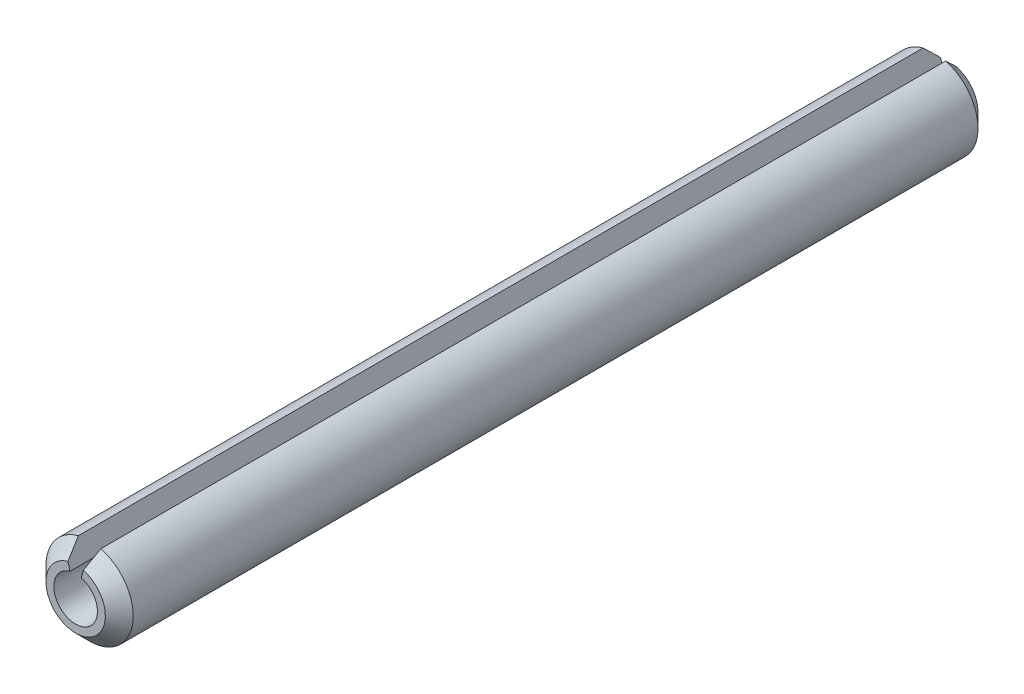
from build123d import *

# Parameters (mm, degrees)
EXTRUDE1_DEPTH = 15.875
CHAMFER1_SIZE  = 0.508


with BuildPart() as part:
    # Sketch1 → Extrude1 (new, symmetric)
    with BuildSketch(Plane.XY):
        with BuildLine():
            Line((0.205437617, 0.766703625), (0.410875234, 1.533407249))
            ThreePointArc((0.410875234, 1.533407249), (0, -1.5875), (-0.410875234, 1.533407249))
            Line((-0.410875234, 1.533407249), (-0.205437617, 0.766703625))
            ThreePointArc((-0.205437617, 0.766703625), (0, -0.79375), (0.205437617, 0.766703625))
        make_face()
    extrude(amount=EXTRUDE1_DEPTH, both=True)

    # Chamfer1
    chamfer1_edges = [part.edges().sort_by_distance(p)[0] for p in [
        (0, -1.5875, 15.875),
        (0, -1.5875, -15.875),
    ]]
    chamfer(chamfer1_edges, length=CHAMFER1_SIZE)


solid = part.part
